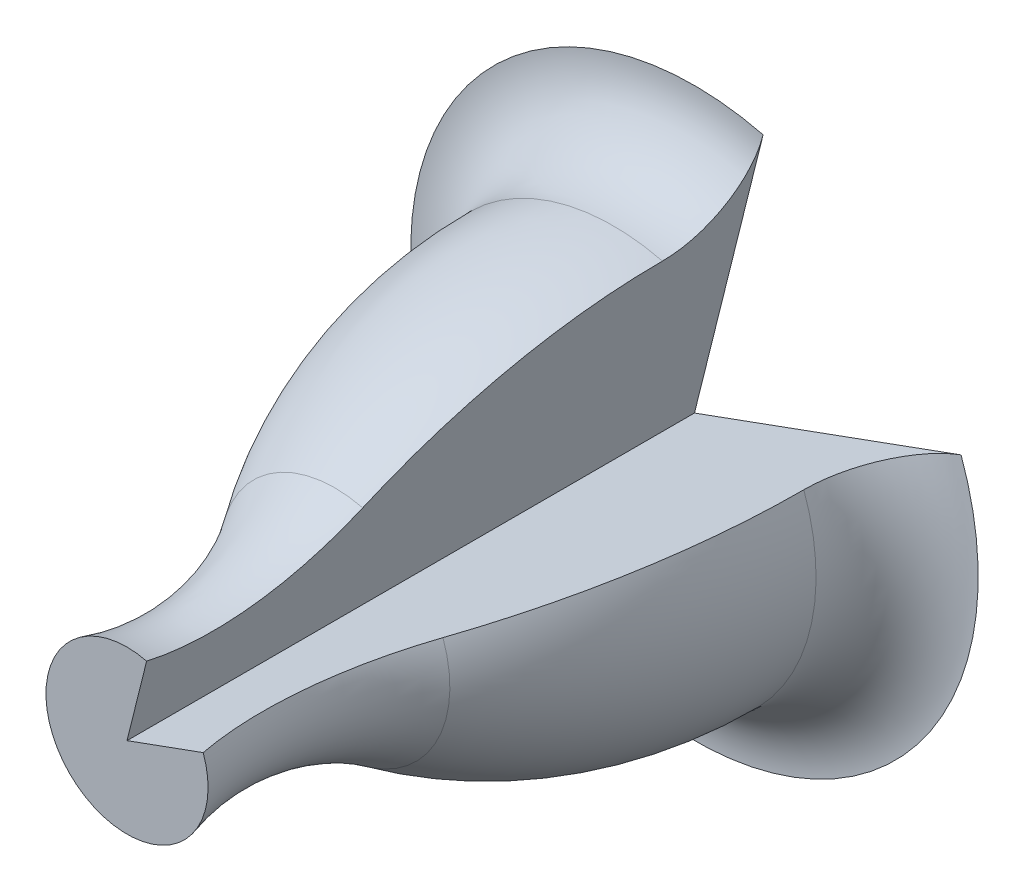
ISO-10303-21;
HEADER;
FILE_DESCRIPTION(('STEP AP214'),'2;1');
FILE_NAME('part.step','',(''),(''),'','','');
FILE_SCHEMA(('AUTOMOTIVE_DESIGN { 1 0 10303 214 1 1 1 1 }'));
ENDSEC;
DATA;
#1=APPLICATION_CONTEXT('core data for automotive mechanical design processes');
#2=APPLICATION_PROTOCOL_DEFINITION('international standard','automotive_design',2000,#1);
#3=PRODUCT_CONTEXT('',#1,'mechanical');
#4=PRODUCT('Part','Part','',(#3));
#5=PRODUCT_RELATED_PRODUCT_CATEGORY('part','',(#4));
#6=PRODUCT_DEFINITION_FORMATION('','',#4);
#7=PRODUCT_DEFINITION_CONTEXT('part definition',#1,'design');
#8=PRODUCT_DEFINITION('design','',#6,#7);
#9=PRODUCT_DEFINITION_SHAPE('','',#8);
#10=(LENGTH_UNIT() NAMED_UNIT(*) SI_UNIT(.MILLI.,.METRE.));
#11=(NAMED_UNIT(*) PLANE_ANGLE_UNIT() SI_UNIT($,.RADIAN.));
#12=(NAMED_UNIT(*) SI_UNIT($,.STERADIAN.) SOLID_ANGLE_UNIT());
#13=UNCERTAINTY_MEASURE_WITH_UNIT(LENGTH_MEASURE(1.E-05),#10,'distance_accuracy_value','');
#14=(GEOMETRIC_REPRESENTATION_CONTEXT(3) GLOBAL_UNCERTAINTY_ASSIGNED_CONTEXT((#13)) GLOBAL_UNIT_ASSIGNED_CONTEXT((#10,
#11,#12)) REPRESENTATION_CONTEXT('',''));
#15=CARTESIAN_POINT('',(0.,0.,0.));
#16=DIRECTION('',(0.,0.,1.));
#17=DIRECTION('',(1.,0.,0.));
#18=AXIS2_PLACEMENT_3D('',#15,#16,#17);
#19=CARTESIAN_POINT('',(9.39692620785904,3.4202014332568,70.));
#20=DIRECTION('',(0.,0.,-1.));
#21=DIRECTION('',(-1.,0.,0.));
#22=AXIS2_PLACEMENT_3D('',#19,#20,#21);
#23=PLANE('',#22);
#24=CARTESIAN_POINT('',(0.,0.,70.));
#25=DIRECTION('',(0.,0.,-1.));
#26=DIRECTION('',(-1.,0.,0.));
#27=AXIS2_PLACEMENT_3D('',#24,#25,#26);
#28=CIRCLE('',#27,10.);
#29=CARTESIAN_POINT('',(9.39692620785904,3.4202014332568,70.));
#30=VERTEX_POINT('',#29);
#31=CARTESIAN_POINT('',(2.41921895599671,9.70295726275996,70.));
#32=VERTEX_POINT('',#31);
#33=EDGE_CURVE('E11',#30,#32,#28,.T.);
#34=ORIENTED_EDGE('',*,*,#33,.F.);
#35=DIRECTION('',(0.939692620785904,0.34202014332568,0.));
#36=VECTOR('',#35,1.);
#37=CARTESIAN_POINT('',(9.39692620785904,3.4202014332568,70.));
#38=LINE('',#37,#36);
#39=CARTESIAN_POINT('',(0.,0.,70.));
#40=VERTEX_POINT('',#39);
#41=EDGE_CURVE('E93',#40,#30,#38,.T.);
#42=ORIENTED_EDGE('',*,*,#41,.F.);
#43=DIRECTION('',(0.241921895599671,0.970295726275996,0.));
#44=VECTOR('',#43,1.);
#45=CARTESIAN_POINT('',(2.41921895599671,9.70295726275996,70.));
#46=LINE('',#45,#44);
#47=EDGE_CURVE('E92',#40,#32,#46,.T.);
#48=ORIENTED_EDGE('',*,*,#47,.T.);
#49=EDGE_LOOP('',(#34,#42,#48));
#50=FACE_BOUND('',#49,.T.);
#51=ADVANCED_FACE('F35',(#50),#23,.F.);
#52=CARTESIAN_POINT('',(0.,0.,61.5385054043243));
#53=DIRECTION('',(0.,0.,-1.));
#54=DIRECTION('',(-1.,0.,0.));
#55=AXIS2_PLACEMENT_3D('',#52,#53,#54);
#56=TOROIDAL_SURFACE('',#55,38.7819927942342,30.);
#57=CARTESIAN_POINT('',(0.,0.,44.3590036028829));
#58=DIRECTION('',(0.,0.,-1.));
#59=DIRECTION('',(-1.,0.,0.));
#60=AXIS2_PLACEMENT_3D('',#57,#58,#59);
#61=CIRCLE('',#60,14.1879951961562);
#62=CARTESIAN_POINT('',(13.3323543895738,4.85258015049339,44.3590036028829));
#63=VERTEX_POINT('',#62);
#64=CARTESIAN_POINT('',(3.43238669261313,13.7665511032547,44.3590036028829));
#65=VERTEX_POINT('',#64);
#66=EDGE_CURVE('E42',#63,#65,#61,.T.);
#67=ORIENTED_EDGE('',*,*,#66,.F.);
#68=CARTESIAN_POINT('',(36.443152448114,13.2642227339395,61.5385054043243));
#69=DIRECTION('',(0.34202014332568,-0.939692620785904,0.));
#70=DIRECTION('',(0.,0.,-1.));
#71=AXIS2_PLACEMENT_3D('',#68,#69,#70);
#72=CIRCLE('',#71,30.);
#73=EDGE_CURVE('E88',#30,#63,#72,.T.);
#74=ORIENTED_EDGE('',*,*,#73,.F.);
#75=ORIENTED_EDGE('',*,*,#33,.T.);
#76=CARTESIAN_POINT('',(9.38221321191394,37.6300018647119,61.5385054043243));
#77=DIRECTION('',(0.970295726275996,-0.241921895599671,0.));
#78=DIRECTION('',(0.,0.,-1.));
#79=AXIS2_PLACEMENT_3D('',#76,#77,#78);
#80=CIRCLE('',#79,30.);
#81=EDGE_CURVE('E85',#32,#65,#80,.T.);
#82=ORIENTED_EDGE('',*,*,#81,.T.);
#83=EDGE_LOOP('',(#67,#74,#75,#82));
#84=FACE_BOUND('',#83,.T.);
#85=ADVANCED_FACE('F83',(#84),#56,.F.);
#86=CARTESIAN_POINT('',(0.,0.,9.99999999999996));
#87=DIRECTION('',(0.,0.,-1.));
#88=DIRECTION('',(-1.,0.,0.));
#89=AXIS2_PLACEMENT_3D('',#86,#87,#88);
#90=DEGENERATE_TOROIDAL_SURFACE('',#89,35.,60.,.F.);
#91=CARTESIAN_POINT('',(0.,0.,9.99999999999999));
#92=DIRECTION('',(0.,0.,-1.));
#93=DIRECTION('',(-1.,0.,0.));
#94=AXIS2_PLACEMENT_3D('',#91,#92,#93);
#95=CIRCLE('',#94,25.);
#96=CARTESIAN_POINT('',(23.4923155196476,8.55050358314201,9.99999999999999));
#97=VERTEX_POINT('',#96);
#98=CARTESIAN_POINT('',(6.04804738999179,24.2573931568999,9.99999999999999));
#99=VERTEX_POINT('',#98);
#100=EDGE_CURVE('E120',#97,#99,#95,.T.);
#101=ORIENTED_EDGE('',*,*,#100,.F.);
#102=CARTESIAN_POINT('',(-32.8892417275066,-11.9707050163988,9.99999999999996));
#103=DIRECTION('',(-0.34202014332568,0.939692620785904,0.));
#104=DIRECTION('',(0.,0.,1.));
#105=AXIS2_PLACEMENT_3D('',#102,#103,#104);
#106=CIRCLE('',#105,60.);
#107=EDGE_CURVE('E111',#63,#97,#106,.T.);
#108=ORIENTED_EDGE('',*,*,#107,.F.);
#109=ORIENTED_EDGE('',*,*,#66,.T.);
#110=CARTESIAN_POINT('',(-8.4672663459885,-33.9603504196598,9.99999999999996));
#111=DIRECTION('',(-0.970295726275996,0.241921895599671,0.));
#112=DIRECTION('',(0.,0.,1.));
#113=AXIS2_PLACEMENT_3D('',#110,#111,#112);
#114=CIRCLE('',#113,60.);
#115=EDGE_CURVE('E100',#65,#99,#114,.T.);
#116=ORIENTED_EDGE('',*,*,#115,.T.);
#117=EDGE_LOOP('',(#101,#108,#109,#116));
#118=FACE_BOUND('',#117,.T.);
#119=ADVANCED_FACE('F123',(#118),#90,.F.);
#120=CARTESIAN_POINT('',(0.,0.,10.));
#121=DIRECTION('',(0.,0.,-1.));
#122=DIRECTION('',(-1.,0.,0.));
#123=AXIS2_PLACEMENT_3D('',#120,#121,#122);
#124=TOROIDAL_SURFACE('',#123,35.,9.99999999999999);
#125=CARTESIAN_POINT('',(0.,0.,0.));
#126=DIRECTION('',(0.,0.,-1.));
#127=DIRECTION('',(-1.,0.,0.));
#128=AXIS2_PLACEMENT_3D('',#125,#126,#127);
#129=CIRCLE('',#128,35.);
#130=CARTESIAN_POINT('',(32.8892417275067,11.9707050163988,0.));
#131=VERTEX_POINT('',#130);
#132=CARTESIAN_POINT('',(8.4672663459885,33.9603504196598,0.));
#133=VERTEX_POINT('',#132);
#134=EDGE_CURVE('E56',#131,#133,#129,.T.);
#135=ORIENTED_EDGE('',*,*,#134,.F.);
#136=CARTESIAN_POINT('',(32.8892417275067,11.9707050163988,10.));
#137=DIRECTION('',(0.34202014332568,-0.939692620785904,0.));
#138=DIRECTION('',(0.,0.,-1.));
#139=AXIS2_PLACEMENT_3D('',#136,#137,#138);
#140=CIRCLE('',#139,9.99999999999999);
#141=EDGE_CURVE('E114',#97,#131,#140,.T.);
#142=ORIENTED_EDGE('',*,*,#141,.F.);
#143=ORIENTED_EDGE('',*,*,#100,.T.);
#144=CARTESIAN_POINT('',(8.4672663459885,33.9603504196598,10.));
#145=DIRECTION('',(0.970295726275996,-0.241921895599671,0.));
#146=DIRECTION('',(0.,0.,-1.));
#147=AXIS2_PLACEMENT_3D('',#144,#145,#146);
#148=CIRCLE('',#147,9.99999999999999);
#149=EDGE_CURVE('E102',#99,#133,#148,.T.);
#150=ORIENTED_EDGE('',*,*,#149,.T.);
#151=EDGE_LOOP('',(#135,#142,#143,#150));
#152=FACE_BOUND('',#151,.T.);
#153=ADVANCED_FACE('F126',(#152),#124,.F.);
#154=CARTESIAN_POINT('',(0.,0.,0.));
#155=DIRECTION('',(0.,0.,1.));
#156=DIRECTION('',(1.,0.,0.));
#157=AXIS2_PLACEMENT_3D('',#154,#155,#156);
#158=PLANE('',#157);
#159=DIRECTION('',(-0.939692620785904,-0.34202014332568,0.));
#160=VECTOR('',#159,1.);
#161=CARTESIAN_POINT('',(0.,0.,0.));
#162=LINE('',#161,#160);
#163=CARTESIAN_POINT('',(0.,0.,0.));
#164=VERTEX_POINT('',#163);
#165=EDGE_CURVE('E116',#131,#164,#162,.T.);
#166=ORIENTED_EDGE('',*,*,#165,.F.);
#167=ORIENTED_EDGE('',*,*,#134,.T.);
#168=DIRECTION('',(-0.241921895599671,-0.970295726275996,0.));
#169=VECTOR('',#168,1.);
#170=CARTESIAN_POINT('',(0.,0.,0.));
#171=LINE('',#170,#169);
#172=EDGE_CURVE('E49',#133,#164,#171,.T.);
#173=ORIENTED_EDGE('',*,*,#172,.T.);
#174=EDGE_LOOP('',(#166,#167,#173));
#175=FACE_BOUND('',#174,.T.);
#176=ADVANCED_FACE('F127',(#175),#158,.F.);
#177=CARTESIAN_POINT('',(32.8892417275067,11.9707050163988,10.));
#178=DIRECTION('',(-0.34202014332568,0.939692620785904,0.));
#179=DIRECTION('',(0.,0.,-1.));
#180=AXIS2_PLACEMENT_3D('',#177,#178,#179);
#181=PLANE('',#180);
#182=DIRECTION('',(0.,0.,1.));
#183=VECTOR('',#182,1.);
#184=CARTESIAN_POINT('',(0.,0.,70.));
#185=LINE('',#184,#183);
#186=EDGE_CURVE('E107',#164,#40,#185,.T.);
#187=ORIENTED_EDGE('',*,*,#186,.T.);
#188=ORIENTED_EDGE('',*,*,#41,.T.);
#189=ORIENTED_EDGE('',*,*,#73,.T.);
#190=ORIENTED_EDGE('',*,*,#107,.T.);
#191=ORIENTED_EDGE('',*,*,#141,.T.);
#192=ORIENTED_EDGE('',*,*,#165,.T.);
#193=EDGE_LOOP('',(#187,#188,#189,#190,#191,#192));
#194=FACE_BOUND('',#193,.T.);
#195=ADVANCED_FACE('F125',(#194),#181,.T.);
#196=CARTESIAN_POINT('',(8.4672663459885,33.9603504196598,10.));
#197=DIRECTION('',(-0.970295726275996,0.241921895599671,0.));
#198=DIRECTION('',(0.,0.,-1.));
#199=AXIS2_PLACEMENT_3D('',#196,#197,#198);
#200=PLANE('',#199);
#201=ORIENTED_EDGE('',*,*,#186,.F.);
#202=ORIENTED_EDGE('',*,*,#172,.F.);
#203=ORIENTED_EDGE('',*,*,#149,.F.);
#204=ORIENTED_EDGE('',*,*,#115,.F.);
#205=ORIENTED_EDGE('',*,*,#81,.F.);
#206=ORIENTED_EDGE('',*,*,#47,.F.);
#207=EDGE_LOOP('',(#201,#202,#203,#204,#205,#206));
#208=FACE_BOUND('',#207,.T.);
#209=ADVANCED_FACE('F97',(#208),#200,.F.);
#210=CLOSED_SHELL('',(#51,#85,#119,#153,#176,#195,#209));
#211=MANIFOLD_SOLID_BREP('B2',#210);
#212=ADVANCED_BREP_SHAPE_REPRESENTATION('',(#18,#211),#14);
#213=SHAPE_DEFINITION_REPRESENTATION(#9,#212);
ENDSEC;
END-ISO-10303-21;
